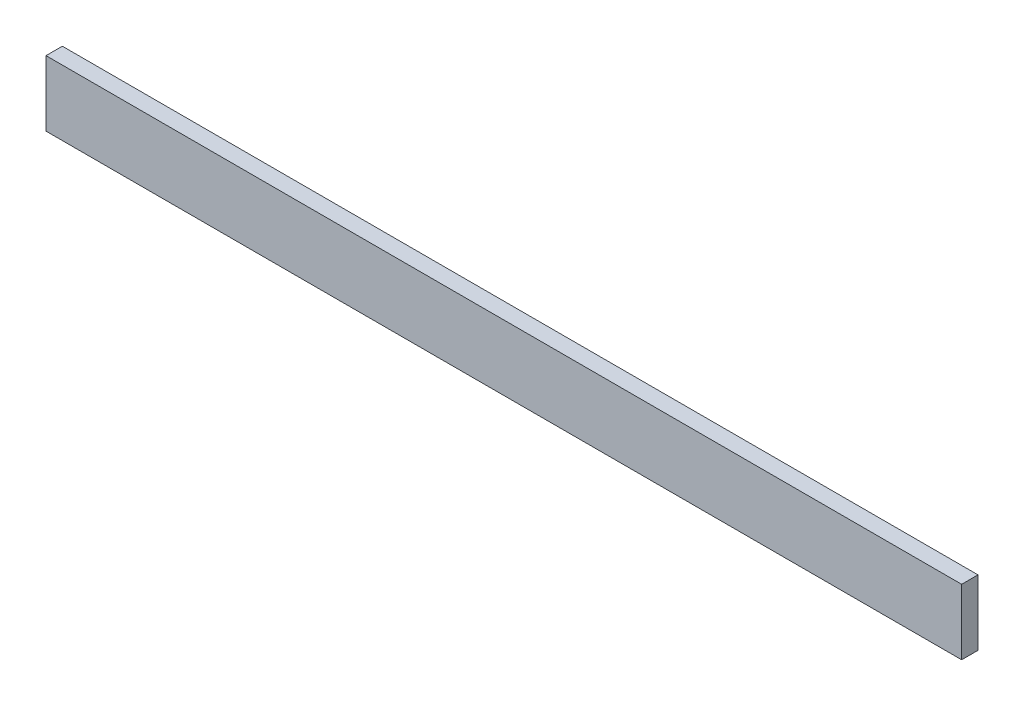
ISO-10303-21;
HEADER;
FILE_DESCRIPTION(('STEP AP214'),'2;1');
FILE_NAME('part.step','',(''),(''),'','','');
FILE_SCHEMA(('AUTOMOTIVE_DESIGN { 1 0 10303 214 1 1 1 1 }'));
ENDSEC;
DATA;
#1=APPLICATION_CONTEXT('core data for automotive mechanical design processes');
#2=APPLICATION_PROTOCOL_DEFINITION('international standard','automotive_design',2000,#1);
#3=PRODUCT_CONTEXT('',#1,'mechanical');
#4=PRODUCT('Part','Part','',(#3));
#5=PRODUCT_RELATED_PRODUCT_CATEGORY('part','',(#4));
#6=PRODUCT_DEFINITION_FORMATION('','',#4);
#7=PRODUCT_DEFINITION_CONTEXT('part definition',#1,'design');
#8=PRODUCT_DEFINITION('design','',#6,#7);
#9=PRODUCT_DEFINITION_SHAPE('','',#8);
#10=(LENGTH_UNIT() NAMED_UNIT(*) SI_UNIT(.MILLI.,.METRE.));
#11=(NAMED_UNIT(*) PLANE_ANGLE_UNIT() SI_UNIT($,.RADIAN.));
#12=(NAMED_UNIT(*) SI_UNIT($,.STERADIAN.) SOLID_ANGLE_UNIT());
#13=UNCERTAINTY_MEASURE_WITH_UNIT(LENGTH_MEASURE(1.E-05),#10,'distance_accuracy_value','');
#14=(GEOMETRIC_REPRESENTATION_CONTEXT(3) GLOBAL_UNCERTAINTY_ASSIGNED_CONTEXT((#13)) GLOBAL_UNIT_ASSIGNED_CONTEXT((#10,
#11,#12)) REPRESENTATION_CONTEXT('',''));
#15=CARTESIAN_POINT('',(0.,0.,0.));
#16=DIRECTION('',(0.,0.,1.));
#17=DIRECTION('',(1.,0.,0.));
#18=AXIS2_PLACEMENT_3D('',#15,#16,#17);
#19=CARTESIAN_POINT('',(0.,0.,19.05));
#20=DIRECTION('',(1.,0.,0.));
#21=DIRECTION('',(0.,0.,-1.));
#22=AXIS2_PLACEMENT_3D('',#19,#20,#21);
#23=PLANE('',#22);
#24=DIRECTION('',(0.,-1.,0.));
#25=VECTOR('',#24,1.);
#26=CARTESIAN_POINT('',(0.,0.,0.));
#27=LINE('',#26,#25);
#28=CARTESIAN_POINT('',(0.,76.2,0.));
#29=VERTEX_POINT('',#28);
#30=CARTESIAN_POINT('',(0.,0.,0.));
#31=VERTEX_POINT('',#30);
#32=EDGE_CURVE('E70',#29,#31,#27,.T.);
#33=ORIENTED_EDGE('',*,*,#32,.T.);
#34=DIRECTION('',(0.,0.,-1.));
#35=VECTOR('',#34,1.);
#36=CARTESIAN_POINT('',(0.,0.,19.05));
#37=LINE('',#36,#35);
#38=CARTESIAN_POINT('',(0.,0.,19.05));
#39=VERTEX_POINT('',#38);
#40=EDGE_CURVE('E11',#39,#31,#37,.T.);
#41=ORIENTED_EDGE('',*,*,#40,.F.);
#42=DIRECTION('',(0.,-1.,0.));
#43=VECTOR('',#42,1.);
#44=CARTESIAN_POINT('',(0.,0.,19.05));
#45=LINE('',#44,#43);
#46=CARTESIAN_POINT('',(0.,76.2,19.05));
#47=VERTEX_POINT('',#46);
#48=EDGE_CURVE('E88',#47,#39,#45,.T.);
#49=ORIENTED_EDGE('',*,*,#48,.F.);
#50=DIRECTION('',(0.,0.,-1.));
#51=VECTOR('',#50,1.);
#52=CARTESIAN_POINT('',(0.,76.2,19.05));
#53=LINE('',#52,#51);
#54=EDGE_CURVE('E82',#47,#29,#53,.T.);
#55=ORIENTED_EDGE('',*,*,#54,.T.);
#56=EDGE_LOOP('',(#33,#41,#49,#55));
#57=FACE_BOUND('',#56,.T.);
#58=ADVANCED_FACE('F26',(#57),#23,.F.);
#59=CARTESIAN_POINT('',(0.,0.,19.05));
#60=DIRECTION('',(0.,1.,0.));
#61=DIRECTION('',(0.,0.,1.));
#62=AXIS2_PLACEMENT_3D('',#59,#60,#61);
#63=PLANE('',#62);
#64=DIRECTION('',(1.,0.,0.));
#65=VECTOR('',#64,1.);
#66=CARTESIAN_POINT('',(0.,0.,0.));
#67=LINE('',#66,#65);
#68=CARTESIAN_POINT('',(1066.8,0.,0.));
#69=VERTEX_POINT('',#68);
#70=EDGE_CURVE('E66',#31,#69,#67,.T.);
#71=ORIENTED_EDGE('',*,*,#70,.T.);
#72=DIRECTION('',(0.,0.,-1.));
#73=VECTOR('',#72,1.);
#74=CARTESIAN_POINT('',(1066.8,0.,19.05));
#75=LINE('',#74,#73);
#76=CARTESIAN_POINT('',(1066.8,0.,19.05));
#77=VERTEX_POINT('',#76);
#78=EDGE_CURVE('E33',#77,#69,#75,.T.);
#79=ORIENTED_EDGE('',*,*,#78,.F.);
#80=DIRECTION('',(1.,0.,0.));
#81=VECTOR('',#80,1.);
#82=CARTESIAN_POINT('',(0.,0.,19.05));
#83=LINE('',#82,#81);
#84=EDGE_CURVE('E78',#39,#77,#83,.T.);
#85=ORIENTED_EDGE('',*,*,#84,.F.);
#86=ORIENTED_EDGE('',*,*,#40,.T.);
#87=EDGE_LOOP('',(#71,#79,#85,#86));
#88=FACE_BOUND('',#87,.T.);
#89=ADVANCED_FACE('F77',(#88),#63,.F.);
#90=CARTESIAN_POINT('',(1066.8,0.,19.05));
#91=DIRECTION('',(-1.,0.,0.));
#92=DIRECTION('',(0.,0.,1.));
#93=AXIS2_PLACEMENT_3D('',#90,#91,#92);
#94=PLANE('',#93);
#95=DIRECTION('',(0.,1.,0.));
#96=VECTOR('',#95,1.);
#97=CARTESIAN_POINT('',(1066.8,0.,0.));
#98=LINE('',#97,#96);
#99=CARTESIAN_POINT('',(1066.8,76.2,0.));
#100=VERTEX_POINT('',#99);
#101=EDGE_CURVE('E71',#69,#100,#98,.T.);
#102=ORIENTED_EDGE('',*,*,#101,.T.);
#103=DIRECTION('',(0.,0.,-1.));
#104=VECTOR('',#103,1.);
#105=CARTESIAN_POINT('',(1066.8,76.2,19.05));
#106=LINE('',#105,#104);
#107=CARTESIAN_POINT('',(1066.8,76.2,19.05));
#108=VERTEX_POINT('',#107);
#109=EDGE_CURVE('E94',#108,#100,#106,.T.);
#110=ORIENTED_EDGE('',*,*,#109,.F.);
#111=DIRECTION('',(0.,1.,0.));
#112=VECTOR('',#111,1.);
#113=CARTESIAN_POINT('',(1066.8,0.,19.05));
#114=LINE('',#113,#112);
#115=EDGE_CURVE('E45',#77,#108,#114,.T.);
#116=ORIENTED_EDGE('',*,*,#115,.F.);
#117=ORIENTED_EDGE('',*,*,#78,.T.);
#118=EDGE_LOOP('',(#102,#110,#116,#117));
#119=FACE_BOUND('',#118,.T.);
#120=ADVANCED_FACE('F97',(#119),#94,.F.);
#121=CARTESIAN_POINT('',(0.,76.2,19.05));
#122=DIRECTION('',(0.,-1.,0.));
#123=DIRECTION('',(1.,0.,0.));
#124=AXIS2_PLACEMENT_3D('',#121,#122,#123);
#125=PLANE('',#124);
#126=DIRECTION('',(-1.,0.,0.));
#127=VECTOR('',#126,1.);
#128=CARTESIAN_POINT('',(0.,76.2,0.));
#129=LINE('',#128,#127);
#130=EDGE_CURVE('E86',#100,#29,#129,.T.);
#131=ORIENTED_EDGE('',*,*,#130,.T.);
#132=ORIENTED_EDGE('',*,*,#54,.F.);
#133=DIRECTION('',(-1.,0.,0.));
#134=VECTOR('',#133,1.);
#135=CARTESIAN_POINT('',(0.,76.2,19.05));
#136=LINE('',#135,#134);
#137=EDGE_CURVE('E40',#108,#47,#136,.T.);
#138=ORIENTED_EDGE('',*,*,#137,.F.);
#139=ORIENTED_EDGE('',*,*,#109,.T.);
#140=EDGE_LOOP('',(#131,#132,#138,#139));
#141=FACE_BOUND('',#140,.T.);
#142=ADVANCED_FACE('F99',(#141),#125,.F.);
#143=CARTESIAN_POINT('',(0.,0.,19.05));
#144=DIRECTION('',(0.,0.,-1.));
#145=DIRECTION('',(-1.,0.,0.));
#146=AXIS2_PLACEMENT_3D('',#143,#144,#145);
#147=PLANE('',#146);
#148=ORIENTED_EDGE('',*,*,#48,.T.);
#149=ORIENTED_EDGE('',*,*,#84,.T.);
#150=ORIENTED_EDGE('',*,*,#115,.T.);
#151=ORIENTED_EDGE('',*,*,#137,.T.);
#152=EDGE_LOOP('',(#148,#149,#150,#151));
#153=FACE_BOUND('',#152,.T.);
#154=ADVANCED_FACE('F100',(#153),#147,.F.);
#155=CARTESIAN_POINT('',(0.,0.,0.));
#156=DIRECTION('',(0.,0.,-1.));
#157=DIRECTION('',(-1.,0.,0.));
#158=AXIS2_PLACEMENT_3D('',#155,#156,#157);
#159=PLANE('',#158);
#160=ORIENTED_EDGE('',*,*,#32,.F.);
#161=ORIENTED_EDGE('',*,*,#130,.F.);
#162=ORIENTED_EDGE('',*,*,#101,.F.);
#163=ORIENTED_EDGE('',*,*,#70,.F.);
#164=EDGE_LOOP('',(#160,#161,#162,#163));
#165=FACE_BOUND('',#164,.T.);
#166=ADVANCED_FACE('F67',(#165),#159,.T.);
#167=CLOSED_SHELL('',(#58,#89,#120,#142,#154,#166));
#168=MANIFOLD_SOLID_BREP('B2',#167);
#169=ADVANCED_BREP_SHAPE_REPRESENTATION('',(#18,#168),#14);
#170=SHAPE_DEFINITION_REPRESENTATION(#9,#169);
ENDSEC;
END-ISO-10303-21;
